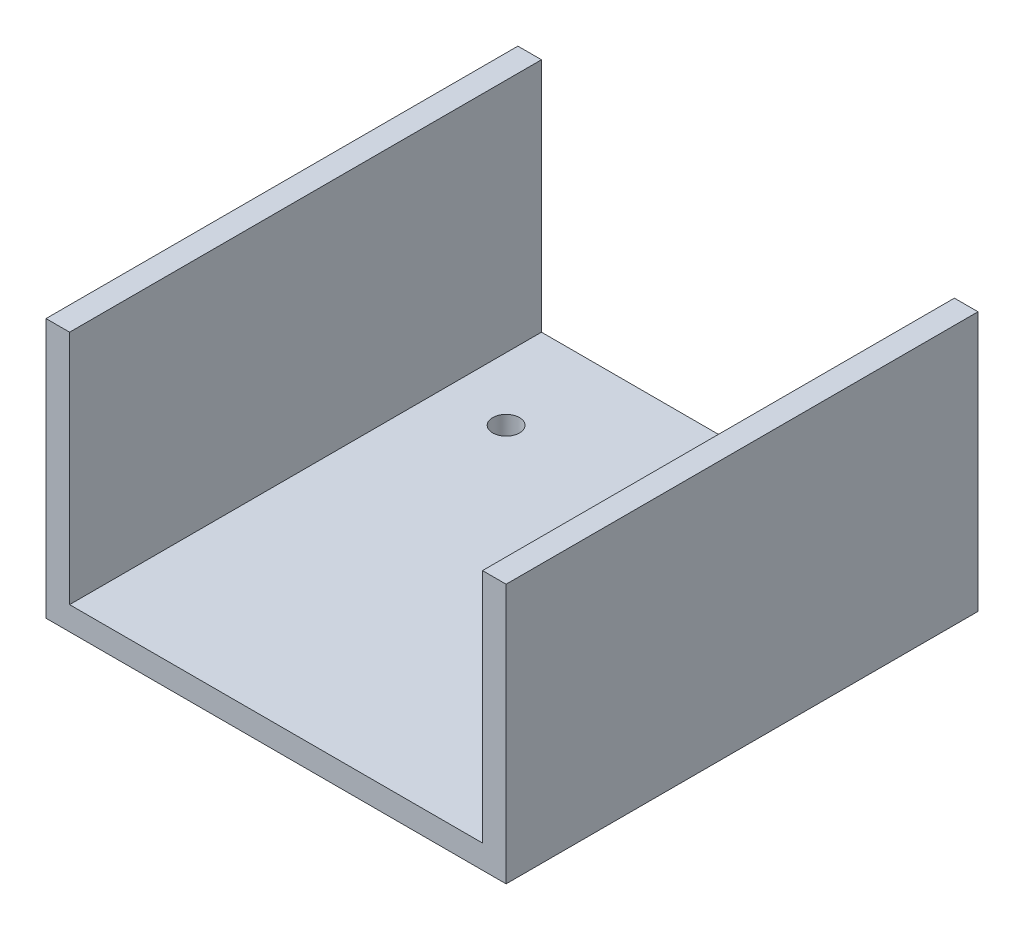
from build123d import *

# Parameters (mm, degrees)
EXTRUSION1_DEPTH      = 120
TROU_TARAUD_M81_D     = 6.8
TROU_TARAUD_M81_DEPTH = 22.25
TROU_TARAUD_M81_TIP   = 2.042926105


with BuildPart() as part:
    # Esquisse1 → Extrusion1 (new body)
    with BuildSketch(Plane.XY):
        Polygon((-52.5, -27), (52.5, -27), (52.5, 33), (58.5, 33), (58.5, -33), (-58.5, -33), (-58.5, 33), (-52.5, 33), align=None)
    extrude(amount=EXTRUSION1_DEPTH)

    # Trou taraud_ M81
    with Locations(Plane.XZ.offset(33)):
        with Locations((-36.5, 25), (39.5, 95)):
            Hole(TROU_TARAUD_M81_D / 2, depth=TROU_TARAUD_M81_DEPTH)
            with Locations((0, 0, -(TROU_TARAUD_M81_DEPTH + TROU_TARAUD_M81_TIP / 2))):  # 118° drill point
                Cone(0, TROU_TARAUD_M81_D / 2, TROU_TARAUD_M81_TIP, mode=Mode.SUBTRACT)


solid = part.part
